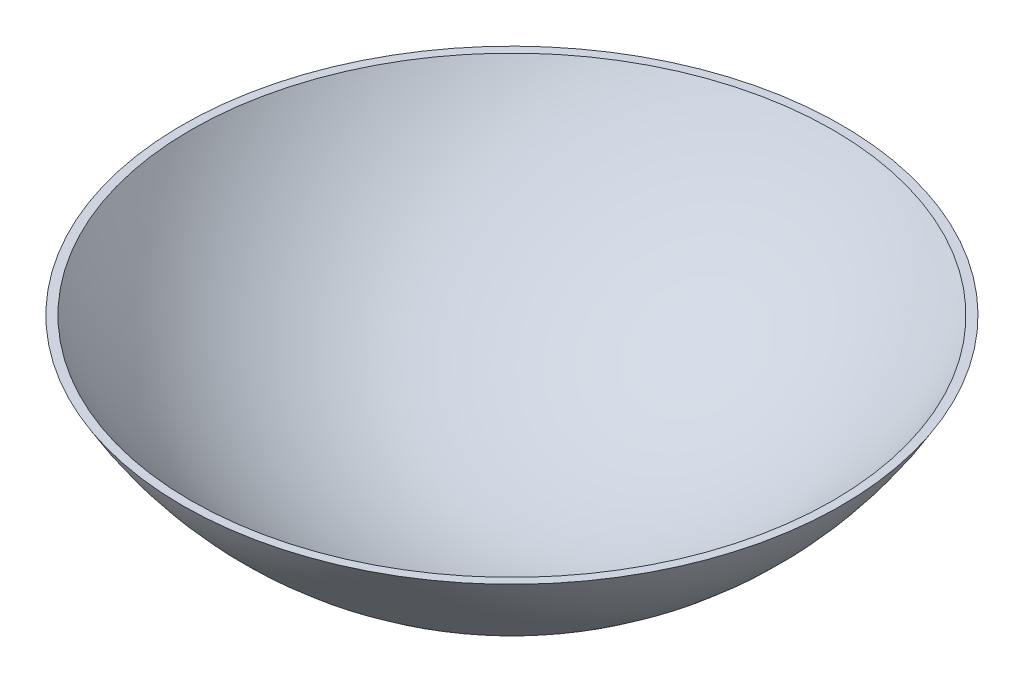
from build123d import *

# Parameters (mm, degrees)
SKETCH2_R      = 0.0005
EXTRUDE1_DEPTH = 81.950602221


with BuildPart() as part:
    # Sketch1 → Revolve4 (revolve)
    with BuildSketch(Plane.XY):
        with BuildLine():
            Line((43.301270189, -25), (44.452221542, -25))
            ThreePointArc((44.452221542, -25), (25.748786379, -44.022721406), (0, -51))
            Line((0, -51), (0, -50))
            ThreePointArc((0, -50), (25, -43.301270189), (43.301270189, -25))
        make_face()
    revolve(axis=Axis((0, 0, 0), (0, -1, 0)))

    # Sketch2 → Extrude1 (cut, through all)
    with BuildSketch(Plane(origin=(0, 0, 0), x_dir=(1, 0, 0), z_dir=(0, 1, 0))):
        with Locations(Location((0, 0, 0), (0, 0, 270))):
            Circle(SKETCH2_R)
    extrude(amount=-EXTRUDE1_DEPTH, mode=Mode.SUBTRACT)


solid = part.part
